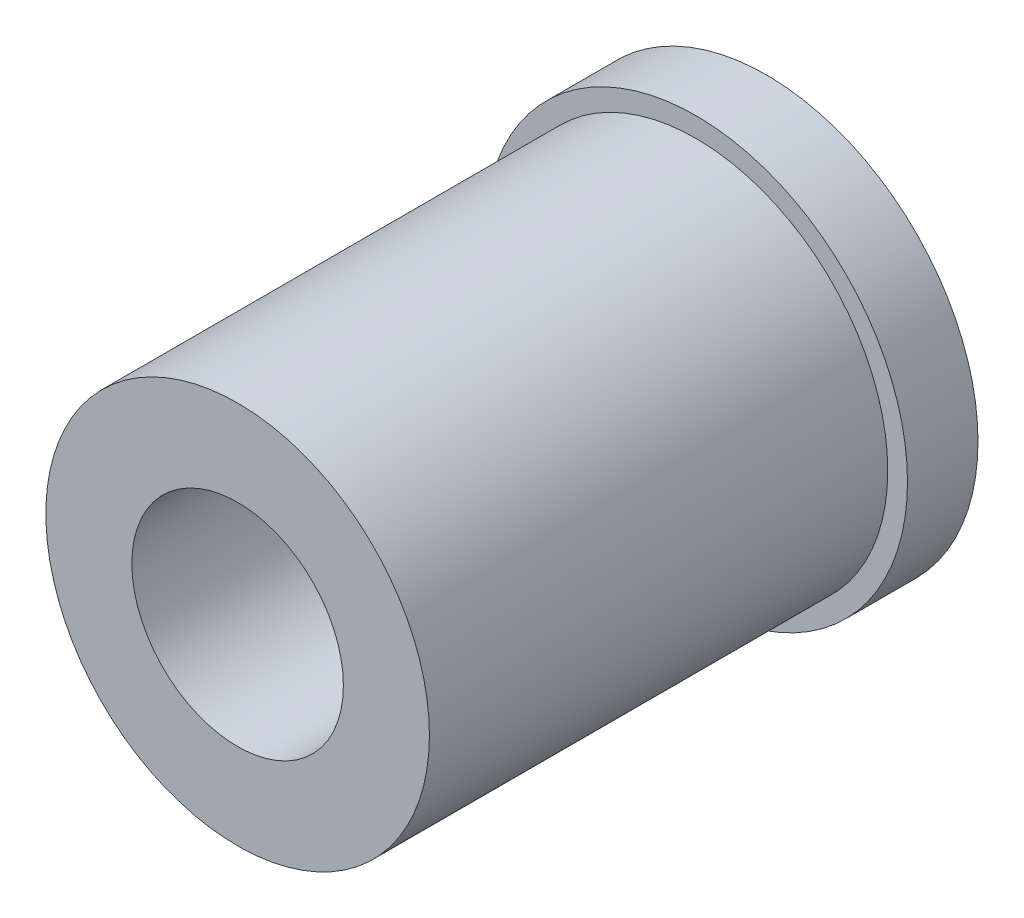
ISO-10303-21;
HEADER;
FILE_DESCRIPTION(('STEP AP214'),'2;1');
FILE_NAME('part.step','',(''),(''),'','','');
FILE_SCHEMA(('AUTOMOTIVE_DESIGN { 1 0 10303 214 1 1 1 1 }'));
ENDSEC;
DATA;
#1=APPLICATION_CONTEXT('core data for automotive mechanical design processes');
#2=APPLICATION_PROTOCOL_DEFINITION('international standard','automotive_design',2000,#1);
#3=PRODUCT_CONTEXT('',#1,'mechanical');
#4=PRODUCT('Part','Part','',(#3));
#5=PRODUCT_RELATED_PRODUCT_CATEGORY('part','',(#4));
#6=PRODUCT_DEFINITION_FORMATION('','',#4);
#7=PRODUCT_DEFINITION_CONTEXT('part definition',#1,'design');
#8=PRODUCT_DEFINITION('design','',#6,#7);
#9=PRODUCT_DEFINITION_SHAPE('','',#8);
#10=(LENGTH_UNIT() NAMED_UNIT(*) SI_UNIT(.MILLI.,.METRE.));
#11=(NAMED_UNIT(*) PLANE_ANGLE_UNIT() SI_UNIT($,.RADIAN.));
#12=(NAMED_UNIT(*) SI_UNIT($,.STERADIAN.) SOLID_ANGLE_UNIT());
#13=UNCERTAINTY_MEASURE_WITH_UNIT(LENGTH_MEASURE(1.E-05),#10,'distance_accuracy_value','');
#14=(GEOMETRIC_REPRESENTATION_CONTEXT(3) GLOBAL_UNCERTAINTY_ASSIGNED_CONTEXT((#13)) GLOBAL_UNIT_ASSIGNED_CONTEXT((#10,
#11,#12)) REPRESENTATION_CONTEXT('',''));
#15=CARTESIAN_POINT('',(0.,0.,0.));
#16=DIRECTION('',(0.,0.,1.));
#17=DIRECTION('',(1.,0.,0.));
#18=AXIS2_PLACEMENT_3D('',#15,#16,#17);
#19=CARTESIAN_POINT('',(0.,0.,23.8125));
#20=DIRECTION('',(0.,0.,1.));
#21=DIRECTION('',(1.,0.,0.));
#22=AXIS2_PLACEMENT_3D('',#19,#20,#21);
#23=PLANE('',#22);
#24=CARTESIAN_POINT('',(0.,0.,23.8125));
#25=DIRECTION('',(0.,0.,1.));
#26=DIRECTION('',(1.,0.,0.));
#27=AXIS2_PLACEMENT_3D('',#24,#25,#26);
#28=CIRCLE('',#27,4.7625);
#29=CARTESIAN_POINT('',(4.7625,0.,23.8125));
#30=VERTEX_POINT('',#29);
#31=EDGE_CURVE('E37',#30,#30,#28,.T.);
#32=ORIENTED_EDGE('',*,*,#31,.F.);
#33=EDGE_LOOP('',(#32));
#34=FACE_BOUND('',#33,.T.);
#35=CARTESIAN_POINT('',(0.,0.,23.8125));
#36=DIRECTION('',(0.,0.,1.));
#37=DIRECTION('',(1.,0.,0.));
#38=AXIS2_PLACEMENT_3D('',#35,#36,#37);
#39=CIRCLE('',#38,8.636);
#40=CARTESIAN_POINT('',(8.636,0.,23.8125));
#41=VERTEX_POINT('',#40);
#42=EDGE_CURVE('E51',#41,#41,#39,.T.);
#43=ORIENTED_EDGE('',*,*,#42,.T.);
#44=EDGE_LOOP('',(#43));
#45=FACE_BOUND('',#44,.T.);
#46=ADVANCED_FACE('F30',(#34,#45),#23,.T.);
#47=CARTESIAN_POINT('',(0.,0.,23.8125));
#48=DIRECTION('',(0.,0.,-1.));
#49=DIRECTION('',(-1.,0.,0.));
#50=AXIS2_PLACEMENT_3D('',#47,#48,#49);
#51=CYLINDRICAL_SURFACE('',#50,9.525);
#52=CARTESIAN_POINT('',(0.,0.,0.));
#53=DIRECTION('',(0.,0.,1.));
#54=DIRECTION('',(1.,0.,0.));
#55=AXIS2_PLACEMENT_3D('',#52,#53,#54);
#56=CIRCLE('',#55,9.525);
#57=CARTESIAN_POINT('',(9.525,0.,0.));
#58=VERTEX_POINT('',#57);
#59=EDGE_CURVE('E10',#58,#58,#56,.T.);
#60=ORIENTED_EDGE('',*,*,#59,.T.);
#61=EDGE_LOOP('',(#60));
#62=FACE_BOUND('',#61,.T.);
#63=CARTESIAN_POINT('',(0.,0.,3.175));
#64=DIRECTION('',(0.,0.,1.));
#65=DIRECTION('',(1.,0.,0.));
#66=AXIS2_PLACEMENT_3D('',#63,#64,#65);
#67=CIRCLE('',#66,9.525);
#68=CARTESIAN_POINT('',(9.525,0.,3.175));
#69=VERTEX_POINT('',#68);
#70=EDGE_CURVE('E46',#69,#69,#67,.T.);
#71=ORIENTED_EDGE('',*,*,#70,.F.);
#72=EDGE_LOOP('',(#71));
#73=FACE_BOUND('',#72,.T.);
#74=ADVANCED_FACE('F32',(#62,#73),#51,.T.);
#75=CARTESIAN_POINT('',(0.,0.,0.));
#76=DIRECTION('',(0.,0.,1.));
#77=DIRECTION('',(1.,0.,0.));
#78=AXIS2_PLACEMENT_3D('',#75,#76,#77);
#79=PLANE('',#78);
#80=ORIENTED_EDGE('',*,*,#59,.F.);
#81=EDGE_LOOP('',(#80));
#82=FACE_BOUND('',#81,.T.);
#83=CARTESIAN_POINT('',(0.,0.,0.));
#84=DIRECTION('',(0.,0.,1.));
#85=DIRECTION('',(1.,0.,0.));
#86=AXIS2_PLACEMENT_3D('',#83,#84,#85);
#87=CIRCLE('',#86,4.7625);
#88=CARTESIAN_POINT('',(4.7625,0.,0.));
#89=VERTEX_POINT('',#88);
#90=EDGE_CURVE('E41',#89,#89,#87,.T.);
#91=ORIENTED_EDGE('',*,*,#90,.T.);
#92=EDGE_LOOP('',(#91));
#93=FACE_BOUND('',#92,.T.);
#94=ADVANCED_FACE('F68',(#82,#93),#79,.F.);
#95=CARTESIAN_POINT('',(0.,0.,23.8125));
#96=DIRECTION('',(0.,0.,-1.));
#97=DIRECTION('',(-1.,0.,0.));
#98=AXIS2_PLACEMENT_3D('',#95,#96,#97);
#99=CYLINDRICAL_SURFACE('',#98,4.7625);
#100=ORIENTED_EDGE('',*,*,#31,.T.);
#101=EDGE_LOOP('',(#100));
#102=FACE_BOUND('',#101,.T.);
#103=ORIENTED_EDGE('',*,*,#90,.F.);
#104=EDGE_LOOP('',(#103));
#105=FACE_BOUND('',#104,.T.);
#106=ADVANCED_FACE('F63',(#102,#105),#99,.F.);
#107=CARTESIAN_POINT('',(0.,0.,3.175));
#108=DIRECTION('',(0.,0.,1.));
#109=DIRECTION('',(1.,0.,0.));
#110=AXIS2_PLACEMENT_3D('',#107,#108,#109);
#111=PLANE('',#110);
#112=CARTESIAN_POINT('',(0.,0.,3.175));
#113=DIRECTION('',(0.,0.,1.));
#114=DIRECTION('',(1.,0.,0.));
#115=AXIS2_PLACEMENT_3D('',#112,#113,#114);
#116=CIRCLE('',#115,8.636);
#117=CARTESIAN_POINT('',(8.636,0.,3.175));
#118=VERTEX_POINT('',#117);
#119=EDGE_CURVE('E50',#118,#118,#116,.T.);
#120=ORIENTED_EDGE('',*,*,#119,.F.);
#121=EDGE_LOOP('',(#120));
#122=FACE_BOUND('',#121,.T.);
#123=ORIENTED_EDGE('',*,*,#70,.T.);
#124=EDGE_LOOP('',(#123));
#125=FACE_BOUND('',#124,.T.);
#126=ADVANCED_FACE('F60',(#122,#125),#111,.T.);
#127=CARTESIAN_POINT('',(0.,0.,3.175));
#128=DIRECTION('',(0.,0.,1.));
#129=DIRECTION('',(1.,0.,0.));
#130=AXIS2_PLACEMENT_3D('',#127,#128,#129);
#131=CYLINDRICAL_SURFACE('',#130,8.636);
#132=ORIENTED_EDGE('',*,*,#119,.T.);
#133=EDGE_LOOP('',(#132));
#134=FACE_BOUND('',#133,.T.);
#135=ORIENTED_EDGE('',*,*,#42,.F.);
#136=EDGE_LOOP('',(#135));
#137=FACE_BOUND('',#136,.T.);
#138=ADVANCED_FACE('F57',(#134,#137),#131,.T.);
#139=CLOSED_SHELL('',(#46,#74,#94,#106,#126,#138));
#140=MANIFOLD_SOLID_BREP('B2',#139);
#141=ADVANCED_BREP_SHAPE_REPRESENTATION('',(#18,#140),#14);
#142=SHAPE_DEFINITION_REPRESENTATION(#9,#141);
ENDSEC;
END-ISO-10303-21;
